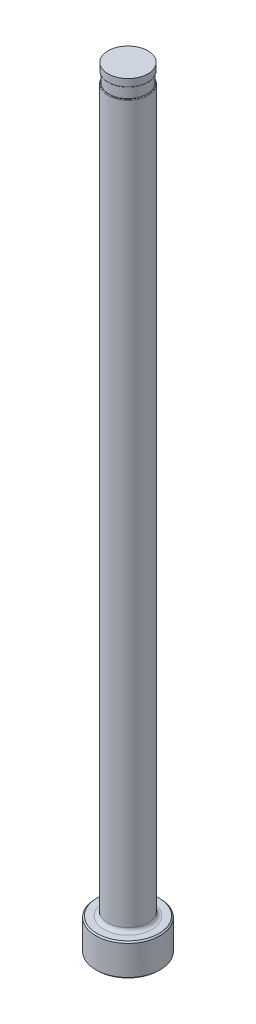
ISO-10303-21;
HEADER;
FILE_DESCRIPTION(('STEP AP214'),'2;1');
FILE_NAME('part.step','',(''),(''),'','','');
FILE_SCHEMA(('AUTOMOTIVE_DESIGN { 1 0 10303 214 1 1 1 1 }'));
ENDSEC;
DATA;
#1=APPLICATION_CONTEXT('core data for automotive mechanical design processes');
#2=APPLICATION_PROTOCOL_DEFINITION('international standard','automotive_design',2000,#1);
#3=PRODUCT_CONTEXT('',#1,'mechanical');
#4=PRODUCT('Part','Part','',(#3));
#5=PRODUCT_RELATED_PRODUCT_CATEGORY('part','',(#4));
#6=PRODUCT_DEFINITION_FORMATION('','',#4);
#7=PRODUCT_DEFINITION_CONTEXT('part definition',#1,'design');
#8=PRODUCT_DEFINITION('design','',#6,#7);
#9=PRODUCT_DEFINITION_SHAPE('','',#8);
#10=(LENGTH_UNIT() NAMED_UNIT(*) SI_UNIT(.MILLI.,.METRE.));
#11=(NAMED_UNIT(*) PLANE_ANGLE_UNIT() SI_UNIT($,.RADIAN.));
#12=(NAMED_UNIT(*) SI_UNIT($,.STERADIAN.) SOLID_ANGLE_UNIT());
#13=UNCERTAINTY_MEASURE_WITH_UNIT(LENGTH_MEASURE(1.E-05),#10,'distance_accuracy_value','');
#14=(GEOMETRIC_REPRESENTATION_CONTEXT(3) GLOBAL_UNCERTAINTY_ASSIGNED_CONTEXT((#13)) GLOBAL_UNIT_ASSIGNED_CONTEXT((#10,
#11,#12)) REPRESENTATION_CONTEXT('',''));
#15=CARTESIAN_POINT('',(0.,0.,0.));
#16=DIRECTION('',(0.,0.,1.));
#17=DIRECTION('',(1.,0.,0.));
#18=AXIS2_PLACEMENT_3D('',#15,#16,#17);
#19=CARTESIAN_POINT('',(-3.96874999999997,150.876,0.));
#20=DIRECTION('',(0.,1.,0.));
#21=DIRECTION('',(0.,0.,1.));
#22=AXIS2_PLACEMENT_3D('',#19,#20,#21);
#23=PLANE('',#22);
#24=CARTESIAN_POINT('',(0.,150.876,0.));
#25=DIRECTION('',(0.,1.,0.));
#26=DIRECTION('',(0.,0.,1.));
#27=AXIS2_PLACEMENT_3D('',#24,#25,#26);
#28=CIRCLE('',#27,3.81634999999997);
#29=CARTESIAN_POINT('',(0.,150.876,3.81634999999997));
#30=VERTEX_POINT('',#29);
#31=EDGE_CURVE('E11',#30,#30,#28,.F.);
#32=ORIENTED_EDGE('',*,*,#31,.T.);
#33=EDGE_LOOP('',(#32));
#34=FACE_BOUND('',#33,.T.);
#35=CARTESIAN_POINT('',(0.,150.876,0.));
#36=DIRECTION('',(0.,1.,0.));
#37=DIRECTION('',(0.,0.,1.));
#38=AXIS2_PLACEMENT_3D('',#35,#36,#37);
#39=CIRCLE('',#38,3.76554999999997);
#40=CARTESIAN_POINT('',(0.,150.876,3.76554999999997));
#41=VERTEX_POINT('',#40);
#42=EDGE_CURVE('E78',#41,#41,#39,.T.);
#43=ORIENTED_EDGE('',*,*,#42,.T.);
#44=EDGE_LOOP('',(#43));
#45=FACE_BOUND('',#44,.T.);
#46=ADVANCED_FACE('F36',(#34,#45),#23,.F.);
#47=CARTESIAN_POINT('',(0.,259.958771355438,0.));
#48=DIRECTION('',(0.,1.,0.));
#49=DIRECTION('',(0.,0.,1.));
#50=AXIS2_PLACEMENT_3D('',#47,#48,#49);
#51=CYLINDRICAL_SURFACE('',#50,3.96874999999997);
#52=DIRECTION('',(0.,1.,0.));
#53=VECTOR('',#52,1.);
#54=CARTESIAN_POINT('',(-3.76554999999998,259.958771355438,-1.25363860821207));
#55=LINE('',#54,#53);
#56=CARTESIAN_POINT('',(-3.76554999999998,148.717,-1.25363860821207));
#57=VERTEX_POINT('',#56);
#58=CARTESIAN_POINT('',(-3.76554999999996,86.36,-1.25363860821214));
#59=VERTEX_POINT('',#58);
#60=EDGE_CURVE('E73',#57,#59,#55,.F.);
#61=ORIENTED_EDGE('',*,*,#60,.F.);
#62=CARTESIAN_POINT('',(0.,148.717,0.));
#63=DIRECTION('',(0.,-1.,0.));
#64=DIRECTION('',(0.,0.,-1.));
#65=AXIS2_PLACEMENT_3D('',#62,#63,#64);
#66=CIRCLE('',#65,3.96874999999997);
#67=CARTESIAN_POINT('',(-3.76554999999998,148.717,1.25363860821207));
#68=VERTEX_POINT('',#67);
#69=EDGE_CURVE('E51',#57,#68,#66,.T.);
#70=ORIENTED_EDGE('',*,*,#69,.T.);
#71=DIRECTION('',(0.,1.,0.));
#72=VECTOR('',#71,1.);
#73=CARTESIAN_POINT('',(-3.76554999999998,259.958771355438,1.25363860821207));
#74=LINE('',#73,#72);
#75=CARTESIAN_POINT('',(-3.76554999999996,86.36,1.25363860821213));
#76=VERTEX_POINT('',#75);
#77=EDGE_CURVE('E84',#76,#68,#74,.T.);
#78=ORIENTED_EDGE('',*,*,#77,.F.);
#79=CARTESIAN_POINT('',(-3.76554999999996,86.36,-1.25363860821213));
#80=CARTESIAN_POINT('',(-3.76554761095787,86.3302664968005,-1.25363893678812));
#81=CARTESIAN_POINT('',(-3.76596820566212,86.3005487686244,-1.25238314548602));
#82=CARTESIAN_POINT('',(-3.76762981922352,86.2413538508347,-1.24737825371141));
#83=CARTESIAN_POINT('',(-3.76887065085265,86.2118766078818,-1.24362972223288));
#84=CARTESIAN_POINT('',(-3.77377172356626,86.1243445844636,-1.22871446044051));
#85=CARTESIAN_POINT('',(-3.77861097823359,86.0669361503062,-1.21387766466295));
#86=CARTESIAN_POINT('',(-3.79089599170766,85.9557164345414,-1.17494432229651));
#87=CARTESIAN_POINT('',(-3.79834108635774,85.9019042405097,-1.1508501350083));
#88=CARTESIAN_POINT('',(-3.81503450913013,85.7992087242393,-1.09423745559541));
#89=CARTESIAN_POINT('',(-3.82428345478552,85.7503270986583,-1.06171607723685));
#90=CARTESIAN_POINT('',(-3.84371902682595,85.658215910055,-0.989050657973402));
#91=CARTESIAN_POINT('',(-3.85391232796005,85.6150327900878,-0.948849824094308));
#92=CARTESIAN_POINT('',(-3.87421414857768,85.535439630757,-0.862218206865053));
#93=CARTESIAN_POINT('',(-3.88432263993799,85.4990317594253,-0.815785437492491));
#94=CARTESIAN_POINT('',(-3.90447970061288,85.4303203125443,-0.713424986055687));
#95=CARTESIAN_POINT('',(-3.91443636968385,85.3987071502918,-0.657016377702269));
#96=CARTESIAN_POINT('',(-3.93230837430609,85.3441594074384,-0.539855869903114));
#97=CARTESIAN_POINT('',(-3.94022284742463,85.3212284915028,-0.479102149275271));
#98=CARTESIAN_POINT('',(-3.95405226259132,85.2820681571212,-0.348163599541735));
#99=CARTESIAN_POINT('',(-3.95966879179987,85.266798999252,-0.277659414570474));
#100=CARTESIAN_POINT('',(-3.96709876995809,85.2467501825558,-0.134969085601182));
#101=CARTESIAN_POINT('',(-3.96891039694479,85.2419755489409,-0.0627821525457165));
#102=CARTESIAN_POINT('',(-3.96855474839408,85.2429169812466,0.0868803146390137));
#103=CARTESIAN_POINT('',(-3.96608295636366,85.2494359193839,0.164351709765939));
#104=CARTESIAN_POINT('',(-3.95680487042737,85.2746115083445,0.317057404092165));
#105=CARTESIAN_POINT('',(-3.9499978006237,85.2932703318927,0.392291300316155));
#106=CARTESIAN_POINT('',(-3.93277618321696,85.3428426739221,0.538182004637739));
#107=CARTESIAN_POINT('',(-3.92236273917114,85.3737524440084,0.608840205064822));
#108=CARTESIAN_POINT('',(-3.8991687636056,85.4477930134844,0.743029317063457));
#109=CARTESIAN_POINT('',(-3.8863895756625,85.4909168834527,0.806564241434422));
#110=CARTESIAN_POINT('',(-3.86127801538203,85.584843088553,0.919000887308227));
#111=CARTESIAN_POINT('',(-3.84899411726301,85.6347331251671,0.968673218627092));
#112=CARTESIAN_POINT('',(-3.82552074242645,85.7433276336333,1.05758636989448));
#113=CARTESIAN_POINT('',(-3.81433058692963,85.8020265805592,1.09683368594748));
#114=CARTESIAN_POINT('',(-3.79578266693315,85.9193369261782,1.15929047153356));
#115=CARTESIAN_POINT('',(-3.78813455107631,85.9772068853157,1.18381204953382));
#116=CARTESIAN_POINT('',(-3.77592606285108,86.096640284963,1.2221998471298));
#117=CARTESIAN_POINT('',(-3.77135975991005,86.1581963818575,1.23608653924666));
#118=CARTESIAN_POINT('',(-3.76759831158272,86.2436117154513,1.24747178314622));
#119=CARTESIAN_POINT('',(-3.76683119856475,86.266841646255,1.24978469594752));
#120=CARTESIAN_POINT('',(-3.76580747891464,86.3133769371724,1.25286606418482));
#121=CARTESIAN_POINT('',(-3.76555004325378,86.3366821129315,1.25363702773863));
#122=CARTESIAN_POINT('',(-3.76554999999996,86.36,1.25363860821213));
#123=B_SPLINE_CURVE_WITH_KNOTS('',3,(#79,#80,#81,#82,#83,#84,#85,#86,#87,#88,#89,#90,#91,#92,
#93,#94,#95,#96,#97,#98,#99,#100,#101,#102,#103,#104,#105,#106,#107,#108,#109,#110,#111,#112,
#113,#114,#115,#116,#117,#118,#119,#120,#121,#122),.UNSPECIFIED.,.F.,.F.,(4,2,2,2,2,2,2,2,2,2,2,
2,2,2,2,2,2,2,2,2,2,4),(0.,0.0891400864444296,0.178259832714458,0.355749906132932,
0.533194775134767,0.71070049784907,0.889573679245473,1.06850400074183,1.26397301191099,
1.45952443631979,1.67567306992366,1.89192518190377,2.12418795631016,2.35649231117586,
2.58872564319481,2.82082748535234,3.03401201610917,3.24706339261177,3.43601078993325,
3.62459353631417,3.6946217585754,3.76453598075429),.UNSPECIFIED.);
#124=EDGE_CURVE('E81',#59,#76,#123,.T.);
#125=ORIENTED_EDGE('',*,*,#124,.F.);
#126=EDGE_LOOP('',(#61,#70,#78,#125));
#127=FACE_BOUND('',#126,.T.);
#128=CARTESIAN_POINT('',(0.,7.11200000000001,0.));
#129=DIRECTION('',(0.,1.,0.));
#130=DIRECTION('',(0.,0.,1.));
#131=AXIS2_PLACEMENT_3D('',#128,#129,#130);
#132=CIRCLE('',#131,3.96874999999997);
#133=CARTESIAN_POINT('',(0.,7.11200000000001,3.96874999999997));
#134=VERTEX_POINT('',#133);
#135=EDGE_CURVE('E116',#134,#134,#132,.T.);
#136=ORIENTED_EDGE('',*,*,#135,.T.);
#137=EDGE_LOOP('',(#136));
#138=FACE_BOUND('',#137,.T.);
#139=ADVANCED_FACE('F82',(#127,#138),#51,.T.);
#140=CARTESIAN_POINT('',(0.,0.,0.));
#141=DIRECTION('',(0.,-1.,0.));
#142=DIRECTION('',(0.,0.,-1.));
#143=AXIS2_PLACEMENT_3D('',#140,#141,#142);
#144=PLANE('',#143);
#145=CARTESIAN_POINT('',(0.,0.,0.));
#146=DIRECTION('',(0.,-1.,0.));
#147=DIRECTION('',(0.,0.,-1.));
#148=AXIS2_PLACEMENT_3D('',#145,#146,#147);
#149=CIRCLE('',#148,6.09599999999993);
#150=CARTESIAN_POINT('',(0.,0.,-6.09599999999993));
#151=VERTEX_POINT('',#150);
#152=EDGE_CURVE('E113',#151,#151,#149,.T.);
#153=ORIENTED_EDGE('',*,*,#152,.T.);
#154=EDGE_LOOP('',(#153));
#155=FACE_BOUND('',#154,.T.);
#156=ADVANCED_FACE('F192',(#155),#144,.T.);
#157=CARTESIAN_POINT('',(0.,259.958771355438,0.));
#158=DIRECTION('',(0.,1.,0.));
#159=DIRECTION('',(0.,0.,1.));
#160=AXIS2_PLACEMENT_3D('',#157,#158,#159);
#161=CYLINDRICAL_SURFACE('',#160,6.34999999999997);
#162=CARTESIAN_POINT('',(0.,6.09599999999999,0.));
#163=DIRECTION('',(0.,1.,0.));
#164=DIRECTION('',(0.,0.,1.));
#165=AXIS2_PLACEMENT_3D('',#162,#163,#164);
#166=CIRCLE('',#165,6.34999999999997);
#167=CARTESIAN_POINT('',(0.,6.09599999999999,6.34999999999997));
#168=VERTEX_POINT('',#167);
#169=EDGE_CURVE('E110',#168,#168,#166,.F.);
#170=ORIENTED_EDGE('',*,*,#169,.T.);
#171=EDGE_LOOP('',(#170));
#172=FACE_BOUND('',#171,.T.);
#173=CARTESIAN_POINT('',(0.,0.254000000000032,0.));
#174=DIRECTION('',(0.,-1.,0.));
#175=DIRECTION('',(0.,0.,-1.));
#176=AXIS2_PLACEMENT_3D('',#173,#174,#175);
#177=CIRCLE('',#176,6.34999999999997);
#178=CARTESIAN_POINT('',(0.,0.254000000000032,-6.34999999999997));
#179=VERTEX_POINT('',#178);
#180=EDGE_CURVE('E107',#179,#179,#177,.F.);
#181=ORIENTED_EDGE('',*,*,#180,.T.);
#182=EDGE_LOOP('',(#181));
#183=FACE_BOUND('',#182,.T.);
#184=ADVANCED_FACE('F195',(#172,#183),#161,.T.);
#185=CARTESIAN_POINT('',(-6.34999999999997,6.35,0.));
#186=DIRECTION('',(0.,1.,0.));
#187=DIRECTION('',(0.,0.,1.));
#188=AXIS2_PLACEMENT_3D('',#185,#186,#187);
#189=PLANE('',#188);
#190=CARTESIAN_POINT('',(0.,6.35,0.));
#191=DIRECTION('',(0.,1.,0.));
#192=DIRECTION('',(0.,0.,1.));
#193=AXIS2_PLACEMENT_3D('',#190,#191,#192);
#194=CIRCLE('',#193,4.73074999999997);
#195=CARTESIAN_POINT('',(0.,6.35,4.73074999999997));
#196=VERTEX_POINT('',#195);
#197=EDGE_CURVE('E87',#196,#196,#194,.F.);
#198=ORIENTED_EDGE('',*,*,#197,.T.);
#199=EDGE_LOOP('',(#198));
#200=FACE_BOUND('',#199,.T.);
#201=CARTESIAN_POINT('',(0.,6.35,0.));
#202=DIRECTION('',(0.,1.,0.));
#203=DIRECTION('',(0.,0.,1.));
#204=AXIS2_PLACEMENT_3D('',#201,#202,#203);
#205=CIRCLE('',#204,6.096);
#206=CARTESIAN_POINT('',(0.,6.35,6.096));
#207=VERTEX_POINT('',#206);
#208=EDGE_CURVE('E104',#207,#207,#205,.T.);
#209=ORIENTED_EDGE('',*,*,#208,.T.);
#210=EDGE_LOOP('',(#209));
#211=FACE_BOUND('',#210,.T.);
#212=ADVANCED_FACE('F190',(#200,#211),#189,.T.);
#213=CARTESIAN_POINT('',(0.,6.35000000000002,0.));
#214=DIRECTION('',(0.,-1.,0.));
#215=DIRECTION('',(0.,0.,-1.));
#216=AXIS2_PLACEMENT_3D('',#213,#214,#215);
#217=CONICAL_SURFACE('',#216,6.09599999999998,0.78539816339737);
#218=ORIENTED_EDGE('',*,*,#169,.F.);
#219=EDGE_LOOP('',(#218));
#220=FACE_BOUND('',#219,.T.);
#221=ORIENTED_EDGE('',*,*,#208,.F.);
#222=EDGE_LOOP('',(#221));
#223=FACE_BOUND('',#222,.T.);
#224=ADVANCED_FACE('F186',(#220,#223),#217,.T.);
#225=CARTESIAN_POINT('',(0.,0.254000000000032,0.));
#226=DIRECTION('',(0.,1.,0.));
#227=DIRECTION('',(0.,0.,1.));
#228=AXIS2_PLACEMENT_3D('',#225,#226,#227);
#229=CONICAL_SURFACE('',#228,6.34999999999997,0.785398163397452);
#230=ORIENTED_EDGE('',*,*,#152,.F.);
#231=EDGE_LOOP('',(#230));
#232=FACE_BOUND('',#231,.T.);
#233=ORIENTED_EDGE('',*,*,#180,.F.);
#234=EDGE_LOOP('',(#233));
#235=FACE_BOUND('',#234,.T.);
#236=ADVANCED_FACE('F182',(#232,#235),#229,.T.);
#237=CARTESIAN_POINT('',(0.,7.11200000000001,0.));
#238=DIRECTION('',(0.,1.,0.));
#239=DIRECTION('',(0.,0.,1.));
#240=AXIS2_PLACEMENT_3D('',#237,#238,#239);
#241=TOROIDAL_SURFACE('',#240,4.73074999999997,0.762);
#242=ORIENTED_EDGE('',*,*,#197,.F.);
#243=EDGE_LOOP('',(#242));
#244=FACE_BOUND('',#243,.T.);
#245=ORIENTED_EDGE('',*,*,#135,.F.);
#246=EDGE_LOOP('',(#245));
#247=FACE_BOUND('',#246,.T.);
#248=ADVANCED_FACE('F147',(#244,#247),#241,.F.);
#249=CARTESIAN_POINT('',(-3.96874999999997,148.844,0.));
#250=DIRECTION('',(0.,-1.,0.));
#251=DIRECTION('',(0.,0.,-1.));
#252=AXIS2_PLACEMENT_3D('',#249,#250,#251);
#253=PLANE('',#252);
#254=DIRECTION('',(0.,0.,1.));
#255=VECTOR('',#254,1.);
#256=CARTESIAN_POINT('',(-3.76554999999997,148.844,0.));
#257=LINE('',#256,#255);
#258=CARTESIAN_POINT('',(-3.76554999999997,148.844,0.));
#259=VERTEX_POINT('',#258);
#260=CARTESIAN_POINT('',(-3.76554999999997,148.844,0.761364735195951));
#261=VERTEX_POINT('',#260);
#262=EDGE_CURVE('E90',#259,#261,#257,.T.);
#263=ORIENTED_EDGE('',*,*,#262,.T.);
#264=CARTESIAN_POINT('',(0.,148.844,0.));
#265=DIRECTION('',(0.,-1.,0.));
#266=DIRECTION('',(0.,0.,-1.));
#267=AXIS2_PLACEMENT_3D('',#264,#265,#266);
#268=CIRCLE('',#267,3.84174999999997);
#269=CARTESIAN_POINT('',(-3.76554999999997,148.844,-0.761364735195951));
#270=VERTEX_POINT('',#269);
#271=EDGE_CURVE('E86',#261,#270,#268,.F.);
#272=ORIENTED_EDGE('',*,*,#271,.T.);
#273=EDGE_CURVE('E79',#270,#259,#257,.T.);
#274=ORIENTED_EDGE('',*,*,#273,.T.);
#275=CARTESIAN_POINT('',(0.,148.844,0.));
#276=DIRECTION('',(0.,1.,0.));
#277=DIRECTION('',(0.,0.,1.));
#278=AXIS2_PLACEMENT_3D('',#275,#276,#277);
#279=CIRCLE('',#278,3.76554999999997);
#280=EDGE_CURVE('E101',#259,#259,#279,.T.);
#281=ORIENTED_EDGE('',*,*,#280,.F.);
#282=EDGE_LOOP('',(#263,#272,#274,#281));
#283=FACE_BOUND('',#282,.T.);
#284=ADVANCED_FACE('F144',(#283),#253,.F.);
#285=CARTESIAN_POINT('',(0.,153.448281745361,0.));
#286=DIRECTION('',(0.,1.,0.));
#287=DIRECTION('',(0.,0.,1.));
#288=AXIS2_PLACEMENT_3D('',#285,#286,#287);
#289=CYLINDRICAL_SURFACE('',#288,3.76554999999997);
#290=ORIENTED_EDGE('',*,*,#42,.F.);
#291=EDGE_LOOP('',(#290));
#292=FACE_BOUND('',#291,.T.);
#293=ORIENTED_EDGE('',*,*,#280,.T.);
#294=EDGE_LOOP('',(#293));
#295=FACE_BOUND('',#294,.T.);
#296=ADVANCED_FACE('F141',(#292,#295),#289,.T.);
#297=CARTESIAN_POINT('',(-3.76554999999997,149.86,-6.34999999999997));
#298=DIRECTION('',(1.,0.,0.));
#299=DIRECTION('',(0.,1.,0.));
#300=AXIS2_PLACEMENT_3D('',#297,#298,#299);
#301=PLANE('',#300);
#302=ORIENTED_EDGE('',*,*,#273,.F.);
#303=CARTESIAN_POINT('',(-3.76554999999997,148.844,-0.761364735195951));
#304=CARTESIAN_POINT('',(-3.76554999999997,148.843994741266,-0.782493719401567));
#305=CARTESIAN_POINT('',(-3.76554999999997,148.843792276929,-0.803626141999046));
#306=CARTESIAN_POINT('',(-3.76554999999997,148.842859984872,-0.845902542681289));
#307=CARTESIAN_POINT('',(-3.76554999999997,148.842129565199,-0.867046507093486));
#308=CARTESIAN_POINT('',(-3.76554999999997,148.840000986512,-0.909439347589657));
#309=CARTESIAN_POINT('',(-3.76554999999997,148.838598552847,-0.930688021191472));
#310=CARTESIAN_POINT('',(-3.76554999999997,148.834932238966,-0.973104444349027));
#311=CARTESIAN_POINT('',(-3.76554999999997,148.832668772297,-0.994272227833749));
#312=CARTESIAN_POINT('',(-3.76554999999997,148.827963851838,-1.02925031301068));
#313=CARTESIAN_POINT('',(-3.76554999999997,148.825847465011,-1.04310326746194));
#314=CARTESIAN_POINT('',(-3.76554999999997,148.820992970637,-1.07067599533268));
#315=CARTESIAN_POINT('',(-3.76554999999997,148.818255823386,-1.08439594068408));
#316=CARTESIAN_POINT('',(-3.76554999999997,148.810714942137,-1.11722771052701));
#317=CARTESIAN_POINT('',(-3.76554999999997,148.805523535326,-1.13626053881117));
#318=CARTESIAN_POINT('',(-3.76554999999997,148.795554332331,-1.16502851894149));
#319=CARTESIAN_POINT('',(-3.76554999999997,148.791656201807,-1.17506664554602));
#320=CARTESIAN_POINT('',(-3.76554999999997,148.782804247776,-1.19465815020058));
#321=CARTESIAN_POINT('',(-3.76554999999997,148.777854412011,-1.20421319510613));
#322=CARTESIAN_POINT('',(-3.76554999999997,148.769843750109,-1.21677899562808));
#323=CARTESIAN_POINT('',(-3.76554999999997,148.767472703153,-1.22022603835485));
#324=CARTESIAN_POINT('',(-3.76554999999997,148.762417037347,-1.22689753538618));
#325=CARTESIAN_POINT('',(-3.76554999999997,148.759731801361,-1.23012153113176));
#326=CARTESIAN_POINT('',(-3.76554999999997,148.753951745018,-1.23626135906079));
#327=CARTESIAN_POINT('',(-3.76554999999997,148.750852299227,-1.23917292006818));
#328=CARTESIAN_POINT('',(-3.76554999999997,148.744201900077,-1.24442799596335));
#329=CARTESIAN_POINT('',(-3.76554999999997,148.740652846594,-1.24677378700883));
#330=CARTESIAN_POINT('',(-3.76554999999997,148.734648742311,-1.24979676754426));
#331=CARTESIAN_POINT('',(-3.76554999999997,148.732340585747,-1.25076391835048));
#332=CARTESIAN_POINT('',(-3.76554999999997,148.727598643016,-1.25230606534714));
#333=CARTESIAN_POINT('',(-3.76554999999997,148.725165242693,-1.25288219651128));
#334=CARTESIAN_POINT('',(-3.76554999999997,148.721758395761,-1.25336754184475));
#335=CARTESIAN_POINT('',(-3.76554999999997,148.720810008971,-1.25346893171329));
#336=CARTESIAN_POINT('',(-3.76554999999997,148.718907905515,-1.25360450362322));
#337=CARTESIAN_POINT('',(-3.76554999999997,148.717954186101,-1.25363864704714));
#338=CARTESIAN_POINT('',(-3.76554999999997,148.717,-1.25363860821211));
#339=B_SPLINE_CURVE_WITH_KNOTS('',3,(#303,#304,#305,#306,#307,#308,#309,#310,#311,#312,#313,
#314,#315,#316,#317,#318,#319,#320,#321,#322,#323,#324,#325,#326,#327,#328,#329,#330,#331,#332,
#333,#334,#335,#336,#337,#338),.UNSPECIFIED.,.F.,.F.,(4,2,2,2,2,2,2,2,2,2,2,2,2,2,2,2,2,4),(0.,
0.0633913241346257,0.126853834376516,0.190725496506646,0.254566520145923,0.296594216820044,
0.338557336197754,0.397605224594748,0.429880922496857,0.462036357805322,0.474575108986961,
0.487138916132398,0.499857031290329,0.512523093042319,0.520004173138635,0.527463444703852,
0.530322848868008,0.533183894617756),.UNSPECIFIED.);
#340=EDGE_CURVE('E59',#270,#57,#339,.T.);
#341=ORIENTED_EDGE('',*,*,#340,.T.);
#342=ORIENTED_EDGE('',*,*,#60,.T.);
#343=DIRECTION('',(0.,0.,1.));
#344=VECTOR('',#343,1.);
#345=CARTESIAN_POINT('',(-3.76554999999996,86.36,-6.34999999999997));
#346=LINE('',#345,#344);
#347=EDGE_CURVE('E77',#59,#76,#346,.T.);
#348=ORIENTED_EDGE('',*,*,#347,.T.);
#349=ORIENTED_EDGE('',*,*,#77,.T.);
#350=CARTESIAN_POINT('',(-3.76554999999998,148.717,1.25363860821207));
#351=CARTESIAN_POINT('',(-3.76554999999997,148.719613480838,1.25364684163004));
#352=CARTESIAN_POINT('',(-3.76554999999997,148.722215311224,1.25338363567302));
#353=CARTESIAN_POINT('',(-3.76554999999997,148.727293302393,1.25239294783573));
#354=CARTESIAN_POINT('',(-3.76554999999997,148.729770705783,1.25167195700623));
#355=CARTESIAN_POINT('',(-3.76554999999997,148.735154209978,1.24961912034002));
#356=CARTESIAN_POINT('',(-3.76554999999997,148.738019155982,1.24818173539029));
#357=CARTESIAN_POINT('',(-3.76554999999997,148.743493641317,1.24486563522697));
#358=CARTESIAN_POINT('',(-3.76554999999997,148.74610160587,1.24298441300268));
#359=CARTESIAN_POINT('',(-3.76554999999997,148.752800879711,1.23749178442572));
#360=CARTESIAN_POINT('',(-3.76554999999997,148.756652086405,1.23359127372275));
#361=CARTESIAN_POINT('',(-3.76554999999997,148.763763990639,1.22529610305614));
#362=CARTESIAN_POINT('',(-3.76554999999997,148.767023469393,1.22090045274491));
#363=CARTESIAN_POINT('',(-3.76554999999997,148.778610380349,1.203601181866));
#364=CARTESIAN_POINT('',(-3.76554999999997,148.785424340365,1.18970762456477));
#365=CARTESIAN_POINT('',(-3.76554999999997,148.797184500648,1.16115732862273));
#366=CARTESIAN_POINT('',(-3.76554999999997,148.802117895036,1.1464961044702));
#367=CARTESIAN_POINT('',(-3.76554999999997,148.813974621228,1.10570448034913));
#368=CARTESIAN_POINT('',(-3.76554999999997,148.819623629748,1.07920308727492));
#369=CARTESIAN_POINT('',(-3.76554999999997,148.82873714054,1.0258152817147));
#370=CARTESIAN_POINT('',(-3.76554999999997,148.832195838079,0.99892803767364));
#371=CARTESIAN_POINT('',(-3.76554999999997,148.837595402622,0.944998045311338));
#372=CARTESIAN_POINT('',(-3.76554999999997,148.839536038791,0.9179552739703));
#373=CARTESIAN_POINT('',(-3.76554999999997,148.842323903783,0.863847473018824));
#374=CARTESIAN_POINT('',(-3.76554999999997,148.843172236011,0.836782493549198));
#375=CARTESIAN_POINT('',(-3.76554999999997,148.843747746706,0.801647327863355));
#376=CARTESIAN_POINT('',(-3.76554999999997,148.84384390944,0.793581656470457));
#377=CARTESIAN_POINT('',(-3.76554999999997,148.843969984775,0.777465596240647));
#378=CARTESIAN_POINT('',(-3.76554999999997,148.844000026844,0.769415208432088));
#379=CARTESIAN_POINT('',(-3.76554999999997,148.844,0.761364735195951));
#380=B_SPLINE_CURVE_WITH_KNOTS('',3,(#350,#351,#352,#353,#354,#355,#356,#357,#358,#359,#360,
#361,#362,#363,#364,#365,#366,#367,#368,#369,#370,#371,#372,#373,#374,#375,#376,#377,#378,#379),
.UNSPECIFIED.,.F.,.F.,(4,2,2,2,2,2,2,2,2,2,2,2,2,2,4),(0.,0.00780850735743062,
0.0155086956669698,0.0250704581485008,0.0346875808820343,0.0510390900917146,0.0674239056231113,
0.113484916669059,0.159854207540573,0.240929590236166,0.322218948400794,0.403520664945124,
0.484740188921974,0.508938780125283,0.533089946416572),.UNSPECIFIED.);
#381=EDGE_CURVE('E172',#68,#261,#380,.T.);
#382=ORIENTED_EDGE('',*,*,#381,.T.);
#383=ORIENTED_EDGE('',*,*,#262,.F.);
#384=EDGE_LOOP('',(#302,#341,#342,#348,#349,#382,#383));
#385=FACE_BOUND('',#384,.T.);
#386=ADVANCED_FACE('F75',(#385),#301,.F.);
#387=CARTESIAN_POINT('',(-6.94054999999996,86.36,-6.34999999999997));
#388=DIRECTION('',(0.,0.,1.));
#389=DIRECTION('',(1.,0.,0.));
#390=AXIS2_PLACEMENT_3D('',#387,#388,#389);
#391=CYLINDRICAL_SURFACE('',#390,3.175);
#392=ORIENTED_EDGE('',*,*,#347,.F.);
#393=ORIENTED_EDGE('',*,*,#124,.T.);
#394=EDGE_LOOP('',(#392,#393));
#395=FACE_BOUND('',#394,.T.);
#396=ADVANCED_FACE('F89',(#395),#391,.F.);
#397=CARTESIAN_POINT('',(0.,152.687735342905,0.));
#398=DIRECTION('',(0.,1.,0.));
#399=DIRECTION('',(0.,0.,1.));
#400=AXIS2_PLACEMENT_3D('',#397,#398,#399);
#401=CYLINDRICAL_SURFACE('',#400,3.94334999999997);
#402=CARTESIAN_POINT('',(0.,151.003,0.));
#403=DIRECTION('',(0.,1.,0.));
#404=DIRECTION('',(0.,0.,1.));
#405=AXIS2_PLACEMENT_3D('',#402,#403,#404);
#406=CIRCLE('',#405,3.94334999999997);
#407=CARTESIAN_POINT('',(0.,151.003,3.94334999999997));
#408=VERTEX_POINT('',#407);
#409=EDGE_CURVE('E44',#408,#408,#406,.T.);
#410=ORIENTED_EDGE('',*,*,#409,.T.);
#411=EDGE_LOOP('',(#410));
#412=FACE_BOUND('',#411,.T.);
#413=CARTESIAN_POINT('',(0.,152.4,0.));
#414=DIRECTION('',(0.,1.,0.));
#415=DIRECTION('',(0.,0.,1.));
#416=AXIS2_PLACEMENT_3D('',#413,#414,#415);
#417=CIRCLE('',#416,3.94334999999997);
#418=CARTESIAN_POINT('',(0.,152.4,3.94334999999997));
#419=VERTEX_POINT('',#418);
#420=EDGE_CURVE('E91',#419,#419,#417,.T.);
#421=ORIENTED_EDGE('',*,*,#420,.F.);
#422=EDGE_LOOP('',(#421));
#423=FACE_BOUND('',#422,.T.);
#424=ADVANCED_FACE('F135',(#412,#423),#401,.T.);
#425=CARTESIAN_POINT('',(-3.96874999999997,152.4,0.));
#426=DIRECTION('',(0.,1.,0.));
#427=DIRECTION('',(0.,0.,1.));
#428=AXIS2_PLACEMENT_3D('',#425,#426,#427);
#429=PLANE('',#428);
#430=ORIENTED_EDGE('',*,*,#420,.T.);
#431=EDGE_LOOP('',(#430));
#432=FACE_BOUND('',#431,.T.);
#433=ADVANCED_FACE('F149',(#432),#429,.T.);
#434=CARTESIAN_POINT('',(0.,148.717,0.));
#435=DIRECTION('',(0.,-1.,0.));
#436=DIRECTION('',(0.,0.,-1.));
#437=AXIS2_PLACEMENT_3D('',#434,#435,#436);
#438=TOROIDAL_SURFACE('',#437,3.84174999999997,0.127);
#439=ORIENTED_EDGE('',*,*,#381,.F.);
#440=ORIENTED_EDGE('',*,*,#69,.F.);
#441=ORIENTED_EDGE('',*,*,#340,.F.);
#442=ORIENTED_EDGE('',*,*,#271,.F.);
#443=EDGE_LOOP('',(#439,#440,#441,#442));
#444=FACE_BOUND('',#443,.T.);
#445=ADVANCED_FACE('F151',(#444),#438,.T.);
#446=CARTESIAN_POINT('',(0.,151.003,0.));
#447=DIRECTION('',(0.,1.,0.));
#448=DIRECTION('',(0.,0.,1.));
#449=AXIS2_PLACEMENT_3D('',#446,#447,#448);
#450=TOROIDAL_SURFACE('',#449,3.81634999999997,0.127);
#451=ORIENTED_EDGE('',*,*,#31,.F.);
#452=EDGE_LOOP('',(#451));
#453=FACE_BOUND('',#452,.T.);
#454=ORIENTED_EDGE('',*,*,#409,.F.);
#455=EDGE_LOOP('',(#454));
#456=FACE_BOUND('',#455,.T.);
#457=ADVANCED_FACE('F38',(#453,#456),#450,.T.);
#458=CLOSED_SHELL('',(#46,#139,#156,#184,#212,#224,#236,#248,#284,#296,#386,#396,#424,#433,#445,#457));
#459=MANIFOLD_SOLID_BREP('B2',#458);
#460=ADVANCED_BREP_SHAPE_REPRESENTATION('',(#18,#459),#14);
#461=SHAPE_DEFINITION_REPRESENTATION(#9,#460);
ENDSEC;
END-ISO-10303-21;
